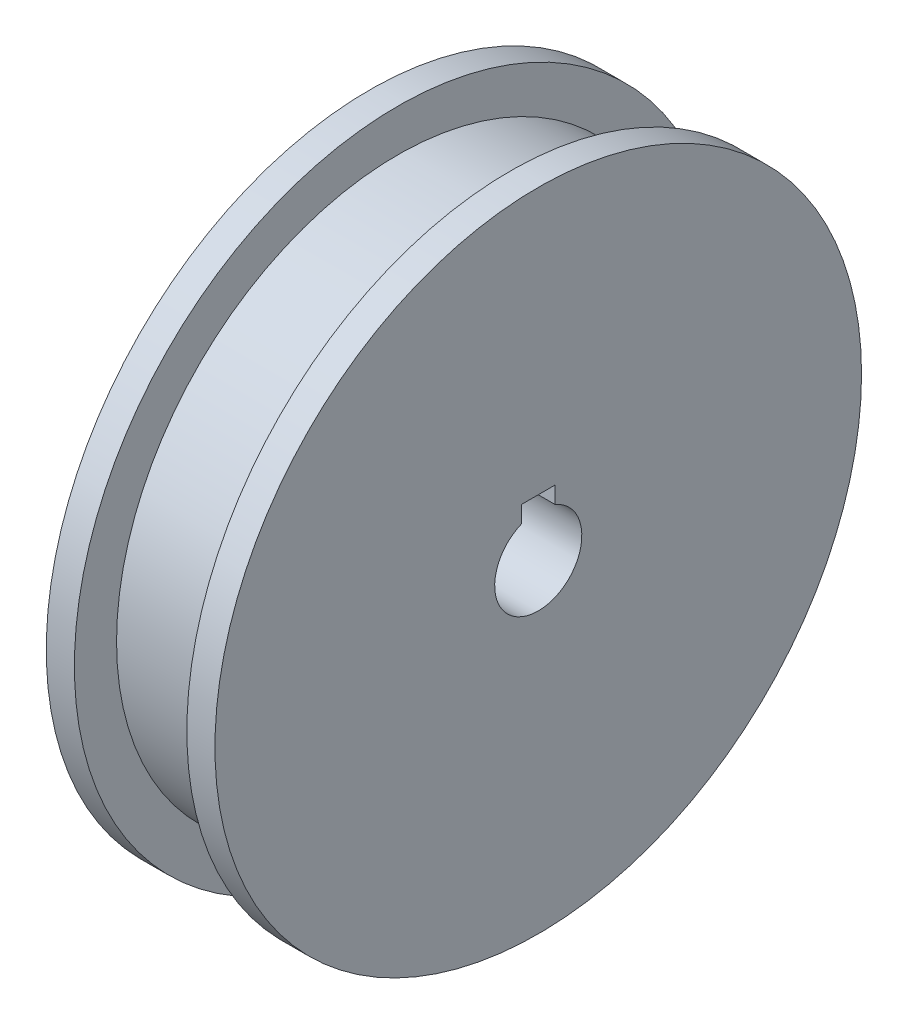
from build123d import *

# Parameters (mm, degrees)
SKETCH_1_R          = 10
EXTRUDE_1_DEPTH     = 3
SKETCH_2_R          = 11.5
SKETCH_2_R_2        = 10
EXTRUDE_2_DEPTH     = 1
CUT_EXTRUDE_1_DEPTH = 18.334935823


with BuildPart() as part:
    # Sketch 1 → Extrude 1 (new, symmetric)
    with BuildSketch(Plane(origin=(0, 0, 0), x_dir=(0, 0, -1), z_dir=(1, 0, 0))):
        Circle(SKETCH_1_R)
    extrude(amount=EXTRUDE_1_DEPTH, both=True)

    # Sketch 2 → Extrude 2 (add)
    with BuildSketch(Plane(origin=(3, 0, 0), x_dir=(0, 0, -1), z_dir=(1, 0, 0))):
        Circle(SKETCH_2_R)
        Circle(SKETCH_2_R_2, mode=Mode.SUBTRACT)
    extrude_2 = extrude(amount=-EXTRUDE_2_DEPTH)

    # Mirror 1: Extrude 2 across plane
    add(extrude_2.mirror(Plane(origin=(0, 0, 0), x_dir=(0, 0, 1), z_dir=(1, 0, 0))))

    # Sketch 3 → Cut-Extrude 1 (cut, through all)
    with BuildSketch(Plane(origin=(3, 0, 0), x_dir=(0, 0, -1), z_dir=(1, 0, 0))):
        with BuildLine():
            Line((0.6, 2.029160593), (-0.6, 2.029160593))
            Line((-0.6, 2.029160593), (-0.6, 1.429160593))
            ThreePointArc((-0.6, 1.429160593), (0, -1.55), (0.6, 1.429160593))
            Line((0.6, 1.429160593), (0.6, 2.029160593))
        make_face()
    extrude(amount=-CUT_EXTRUDE_1_DEPTH, mode=Mode.SUBTRACT)


solid = part.part
